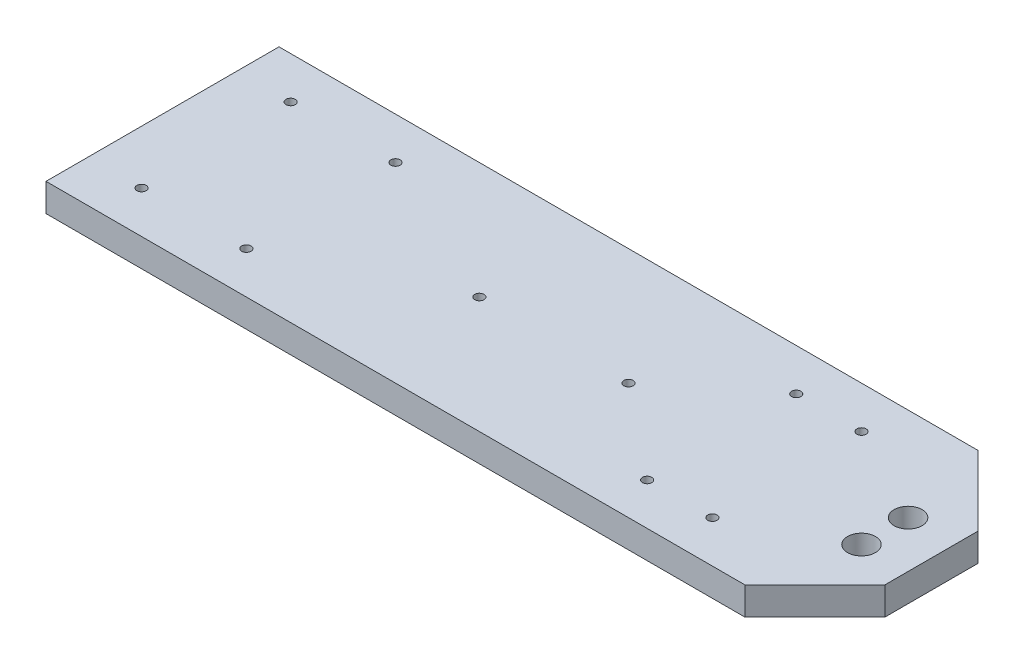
ISO-10303-21;
HEADER;
FILE_DESCRIPTION(('STEP AP214'),'2;1');
FILE_NAME('part.step','',(''),(''),'','','');
FILE_SCHEMA(('AUTOMOTIVE_DESIGN { 1 0 10303 214 1 1 1 1 }'));
ENDSEC;
DATA;
#1=APPLICATION_CONTEXT('core data for automotive mechanical design processes');
#2=APPLICATION_PROTOCOL_DEFINITION('international standard','automotive_design',2000,#1);
#3=PRODUCT_CONTEXT('',#1,'mechanical');
#4=PRODUCT('Part','Part','',(#3));
#5=PRODUCT_RELATED_PRODUCT_CATEGORY('part','',(#4));
#6=PRODUCT_DEFINITION_FORMATION('','',#4);
#7=PRODUCT_DEFINITION_CONTEXT('part definition',#1,'design');
#8=PRODUCT_DEFINITION('design','',#6,#7);
#9=PRODUCT_DEFINITION_SHAPE('','',#8);
#10=(LENGTH_UNIT() NAMED_UNIT(*) SI_UNIT(.MILLI.,.METRE.));
#11=(NAMED_UNIT(*) PLANE_ANGLE_UNIT() SI_UNIT($,.RADIAN.));
#12=(NAMED_UNIT(*) SI_UNIT($,.STERADIAN.) SOLID_ANGLE_UNIT());
#13=UNCERTAINTY_MEASURE_WITH_UNIT(LENGTH_MEASURE(1.E-05),#10,'distance_accuracy_value','');
#14=(GEOMETRIC_REPRESENTATION_CONTEXT(3) GLOBAL_UNCERTAINTY_ASSIGNED_CONTEXT((#13)) GLOBAL_UNIT_ASSIGNED_CONTEXT((#10,
#11,#12)) REPRESENTATION_CONTEXT('',''));
#15=CARTESIAN_POINT('',(0.,0.,0.));
#16=DIRECTION('',(0.,0.,1.));
#17=DIRECTION('',(1.,0.,0.));
#18=AXIS2_PLACEMENT_3D('',#15,#16,#17);
#19=CARTESIAN_POINT('',(0.,6.,0.));
#20=DIRECTION('',(1.,0.,0.));
#21=DIRECTION('',(0.,0.,-1.));
#22=AXIS2_PLACEMENT_3D('',#19,#20,#21);
#23=PLANE('',#22);
#24=DIRECTION('',(0.,0.,1.));
#25=VECTOR('',#24,1.);
#26=CARTESIAN_POINT('',(0.,0.,0.));
#27=LINE('',#26,#25);
#28=CARTESIAN_POINT('',(0.,0.,-50.));
#29=VERTEX_POINT('',#28);
#30=CARTESIAN_POINT('',(0.,0.,0.));
#31=VERTEX_POINT('',#30);
#32=EDGE_CURVE('E83',#29,#31,#27,.T.);
#33=ORIENTED_EDGE('',*,*,#32,.T.);
#34=DIRECTION('',(0.,-1.,0.));
#35=VECTOR('',#34,1.);
#36=CARTESIAN_POINT('',(0.,6.,0.));
#37=LINE('',#36,#35);
#38=CARTESIAN_POINT('',(0.,6.,0.));
#39=VERTEX_POINT('',#38);
#40=EDGE_CURVE('E89',#39,#31,#37,.T.);
#41=ORIENTED_EDGE('',*,*,#40,.F.);
#42=DIRECTION('',(0.,0.,1.));
#43=VECTOR('',#42,1.);
#44=CARTESIAN_POINT('',(0.,6.,0.));
#45=LINE('',#44,#43);
#46=CARTESIAN_POINT('',(0.,6.,-50.));
#47=VERTEX_POINT('',#46);
#48=EDGE_CURVE('E110',#47,#39,#45,.T.);
#49=ORIENTED_EDGE('',*,*,#48,.F.);
#50=DIRECTION('',(0.,-1.,0.));
#51=VECTOR('',#50,1.);
#52=CARTESIAN_POINT('',(0.,6.,-50.));
#53=LINE('',#52,#51);
#54=EDGE_CURVE('E96',#47,#29,#53,.T.);
#55=ORIENTED_EDGE('',*,*,#54,.T.);
#56=EDGE_LOOP('',(#33,#41,#49,#55));
#57=FACE_BOUND('',#56,.T.);
#58=ADVANCED_FACE('F26',(#57),#23,.F.);
#59=CARTESIAN_POINT('',(0.,6.,0.));
#60=DIRECTION('',(0.,0.,-1.));
#61=DIRECTION('',(-1.,0.,0.));
#62=AXIS2_PLACEMENT_3D('',#59,#60,#61);
#63=PLANE('',#62);
#64=DIRECTION('',(1.,0.,0.));
#65=VECTOR('',#64,1.);
#66=CARTESIAN_POINT('',(0.,0.,0.));
#67=LINE('',#66,#65);
#68=CARTESIAN_POINT('',(150.,0.,0.));
#69=VERTEX_POINT('',#68);
#70=EDGE_CURVE('E78',#31,#69,#67,.T.);
#71=ORIENTED_EDGE('',*,*,#70,.T.);
#72=DIRECTION('',(0.,1.,0.));
#73=VECTOR('',#72,1.);
#74=CARTESIAN_POINT('',(150.,6.,0.));
#75=LINE('',#74,#73);
#76=CARTESIAN_POINT('',(150.,6.,0.));
#77=VERTEX_POINT('',#76);
#78=EDGE_CURVE('E11',#69,#77,#75,.T.);
#79=ORIENTED_EDGE('',*,*,#78,.T.);
#80=DIRECTION('',(1.,0.,0.));
#81=VECTOR('',#80,1.);
#82=CARTESIAN_POINT('',(0.,6.,0.));
#83=LINE('',#82,#81);
#84=EDGE_CURVE('E91',#39,#77,#83,.T.);
#85=ORIENTED_EDGE('',*,*,#84,.F.);
#86=ORIENTED_EDGE('',*,*,#40,.T.);
#87=EDGE_LOOP('',(#71,#79,#85,#86));
#88=FACE_BOUND('',#87,.T.);
#89=ADVANCED_FACE('F90',(#88),#63,.F.);
#90=CARTESIAN_POINT('',(165.,6.,0.));
#91=DIRECTION('',(-1.,0.,0.));
#92=DIRECTION('',(0.,0.,1.));
#93=AXIS2_PLACEMENT_3D('',#90,#91,#92);
#94=PLANE('',#93);
#95=DIRECTION('',(0.,0.,-1.));
#96=VECTOR('',#95,1.);
#97=CARTESIAN_POINT('',(165.,0.,0.));
#98=LINE('',#97,#96);
#99=CARTESIAN_POINT('',(165.,0.,-15.));
#100=VERTEX_POINT('',#99);
#101=CARTESIAN_POINT('',(165.,0.,-35.));
#102=VERTEX_POINT('',#101);
#103=EDGE_CURVE('E86',#100,#102,#98,.T.);
#104=ORIENTED_EDGE('',*,*,#103,.T.);
#105=DIRECTION('',(0.,1.,0.));
#106=VECTOR('',#105,1.);
#107=CARTESIAN_POINT('',(165.,6.,-35.));
#108=LINE('',#107,#106);
#109=CARTESIAN_POINT('',(165.,6.,-35.));
#110=VERTEX_POINT('',#109);
#111=EDGE_CURVE('E46',#102,#110,#108,.T.);
#112=ORIENTED_EDGE('',*,*,#111,.T.);
#113=DIRECTION('',(0.,0.,-1.));
#114=VECTOR('',#113,1.);
#115=CARTESIAN_POINT('',(165.,6.,0.));
#116=LINE('',#115,#114);
#117=CARTESIAN_POINT('',(165.,6.,-15.));
#118=VERTEX_POINT('',#117);
#119=EDGE_CURVE('E113',#118,#110,#116,.T.);
#120=ORIENTED_EDGE('',*,*,#119,.F.);
#121=DIRECTION('',(0.,-1.,0.));
#122=VECTOR('',#121,1.);
#123=CARTESIAN_POINT('',(165.,6.,-15.));
#124=LINE('',#123,#122);
#125=EDGE_CURVE('E123',#118,#100,#124,.T.);
#126=ORIENTED_EDGE('',*,*,#125,.T.);
#127=EDGE_LOOP('',(#104,#112,#120,#126));
#128=FACE_BOUND('',#127,.T.);
#129=ADVANCED_FACE('F137',(#128),#94,.F.);
#130=CARTESIAN_POINT('',(0.,6.,-50.));
#131=DIRECTION('',(0.,0.,1.));
#132=DIRECTION('',(1.,0.,0.));
#133=AXIS2_PLACEMENT_3D('',#130,#131,#132);
#134=PLANE('',#133);
#135=DIRECTION('',(-1.,0.,0.));
#136=VECTOR('',#135,1.);
#137=CARTESIAN_POINT('',(0.,6.,-50.));
#138=LINE('',#137,#136);
#139=CARTESIAN_POINT('',(150.,6.,-50.));
#140=VERTEX_POINT('',#139);
#141=EDGE_CURVE('E115',#140,#47,#138,.T.);
#142=ORIENTED_EDGE('',*,*,#141,.F.);
#143=DIRECTION('',(0.,-1.,0.));
#144=VECTOR('',#143,1.);
#145=CARTESIAN_POINT('',(150.,6.,-50.));
#146=LINE('',#145,#144);
#147=CARTESIAN_POINT('',(150.,0.,-50.));
#148=VERTEX_POINT('',#147);
#149=EDGE_CURVE('E95',#140,#148,#146,.T.);
#150=ORIENTED_EDGE('',*,*,#149,.T.);
#151=DIRECTION('',(-1.,0.,0.));
#152=VECTOR('',#151,1.);
#153=CARTESIAN_POINT('',(0.,0.,-50.));
#154=LINE('',#153,#152);
#155=EDGE_CURVE('E108',#148,#29,#154,.T.);
#156=ORIENTED_EDGE('',*,*,#155,.T.);
#157=ORIENTED_EDGE('',*,*,#54,.F.);
#158=EDGE_LOOP('',(#142,#150,#156,#157));
#159=FACE_BOUND('',#158,.T.);
#160=ADVANCED_FACE('F135',(#159),#134,.F.);
#161=CARTESIAN_POINT('',(0.,6.,-50.));
#162=DIRECTION('',(0.,-1.,0.));
#163=DIRECTION('',(0.,0.,-1.));
#164=AXIS2_PLACEMENT_3D('',#161,#162,#163);
#165=PLANE('',#164);
#166=CARTESIAN_POINT('',(155.,6.,-20.));
#167=DIRECTION('',(0.,1.,0.));
#168=DIRECTION('',(0.,0.,-1.));
#169=AXIS2_PLACEMENT_3D('',#166,#167,#168);
#170=CIRCLE('',#169,2.99999999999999);
#171=CARTESIAN_POINT('',(155.,6.,-23.));
#172=VERTEX_POINT('',#171);
#173=EDGE_CURVE('E263',#172,#172,#170,.T.);
#174=ORIENTED_EDGE('',*,*,#173,.F.);
#175=EDGE_LOOP('',(#174));
#176=FACE_BOUND('',#175,.T.);
#177=CARTESIAN_POINT('',(155.,6.,-30.));
#178=DIRECTION('',(0.,1.,0.));
#179=DIRECTION('',(0.,0.,1.));
#180=AXIS2_PLACEMENT_3D('',#177,#178,#179);
#181=CIRCLE('',#180,2.99999999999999);
#182=CARTESIAN_POINT('',(155.,6.,-27.));
#183=VERTEX_POINT('',#182);
#184=EDGE_CURVE('E259',#183,#183,#181,.T.);
#185=ORIENTED_EDGE('',*,*,#184,.F.);
#186=EDGE_LOOP('',(#185));
#187=FACE_BOUND('',#186,.T.);
#188=CARTESIAN_POINT('',(134.,6.,-9.));
#189=DIRECTION('',(0.,1.,0.));
#190=DIRECTION('',(0.,0.,-1.));
#191=AXIS2_PLACEMENT_3D('',#188,#189,#190);
#192=CIRCLE('',#191,0.999999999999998);
#193=CARTESIAN_POINT('',(134.,6.,-10.));
#194=VERTEX_POINT('',#193);
#195=EDGE_CURVE('E255',#194,#194,#192,.T.);
#196=ORIENTED_EDGE('',*,*,#195,.F.);
#197=EDGE_LOOP('',(#196));
#198=FACE_BOUND('',#197,.T.);
#199=CARTESIAN_POINT('',(68.,6.,-25.));
#200=DIRECTION('',(0.,1.,0.));
#201=DIRECTION('',(0.,0.,1.));
#202=AXIS2_PLACEMENT_3D('',#199,#200,#201);
#203=CIRCLE('',#202,0.999999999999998);
#204=CARTESIAN_POINT('',(68.,6.,-24.));
#205=VERTEX_POINT('',#204);
#206=EDGE_CURVE('E251',#205,#205,#203,.T.);
#207=ORIENTED_EDGE('',*,*,#206,.F.);
#208=EDGE_LOOP('',(#207));
#209=FACE_BOUND('',#208,.T.);
#210=CARTESIAN_POINT('',(100.,6.,-25.));
#211=DIRECTION('',(0.,1.,0.));
#212=DIRECTION('',(0.,0.,1.));
#213=AXIS2_PLACEMENT_3D('',#210,#211,#212);
#214=CIRCLE('',#213,0.999999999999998);
#215=CARTESIAN_POINT('',(100.,6.,-24.));
#216=VERTEX_POINT('',#215);
#217=EDGE_CURVE('E247',#216,#216,#214,.T.);
#218=ORIENTED_EDGE('',*,*,#217,.F.);
#219=EDGE_LOOP('',(#218));
#220=FACE_BOUND('',#219,.T.);
#221=CARTESIAN_POINT('',(120.,6.,-9.));
#222=DIRECTION('',(0.,1.,0.));
#223=DIRECTION('',(0.,0.,-1.));
#224=AXIS2_PLACEMENT_3D('',#221,#222,#223);
#225=CIRCLE('',#224,0.999999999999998);
#226=CARTESIAN_POINT('',(120.,6.,-10.));
#227=VERTEX_POINT('',#226);
#228=EDGE_CURVE('E243',#227,#227,#225,.T.);
#229=ORIENTED_EDGE('',*,*,#228,.F.);
#230=EDGE_LOOP('',(#229));
#231=FACE_BOUND('',#230,.T.);
#232=CARTESIAN_POINT('',(34.,6.,-9.));
#233=DIRECTION('',(0.,1.,0.));
#234=DIRECTION('',(0.,0.,-1.));
#235=AXIS2_PLACEMENT_3D('',#232,#233,#234);
#236=CIRCLE('',#235,0.999999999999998);
#237=CARTESIAN_POINT('',(34.,6.,-10.));
#238=VERTEX_POINT('',#237);
#239=EDGE_CURVE('E239',#238,#238,#236,.T.);
#240=ORIENTED_EDGE('',*,*,#239,.F.);
#241=EDGE_LOOP('',(#240));
#242=FACE_BOUND('',#241,.T.);
#243=CARTESIAN_POINT('',(11.5,6.,-9.));
#244=DIRECTION('',(0.,1.,0.));
#245=DIRECTION('',(0.,0.,-1.));
#246=AXIS2_PLACEMENT_3D('',#243,#244,#245);
#247=CIRCLE('',#246,1.);
#248=CARTESIAN_POINT('',(11.5,6.,-10.));
#249=VERTEX_POINT('',#248);
#250=EDGE_CURVE('E235',#249,#249,#247,.T.);
#251=ORIENTED_EDGE('',*,*,#250,.F.);
#252=EDGE_LOOP('',(#251));
#253=FACE_BOUND('',#252,.T.);
#254=CARTESIAN_POINT('',(11.5,6.,-41.));
#255=DIRECTION('',(0.,1.,0.));
#256=DIRECTION('',(0.,0.,1.));
#257=AXIS2_PLACEMENT_3D('',#254,#255,#256);
#258=CIRCLE('',#257,1.);
#259=CARTESIAN_POINT('',(11.5,6.,-40.));
#260=VERTEX_POINT('',#259);
#261=EDGE_CURVE('E231',#260,#260,#258,.T.);
#262=ORIENTED_EDGE('',*,*,#261,.F.);
#263=EDGE_LOOP('',(#262));
#264=FACE_BOUND('',#263,.T.);
#265=CARTESIAN_POINT('',(34.,6.,-41.));
#266=DIRECTION('',(0.,1.,0.));
#267=DIRECTION('',(0.,0.,1.));
#268=AXIS2_PLACEMENT_3D('',#265,#266,#267);
#269=CIRCLE('',#268,0.999999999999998);
#270=CARTESIAN_POINT('',(34.,6.,-40.));
#271=VERTEX_POINT('',#270);
#272=EDGE_CURVE('E227',#271,#271,#269,.T.);
#273=ORIENTED_EDGE('',*,*,#272,.F.);
#274=EDGE_LOOP('',(#273));
#275=FACE_BOUND('',#274,.T.);
#276=CARTESIAN_POINT('',(120.,6.,-41.));
#277=DIRECTION('',(0.,1.,0.));
#278=DIRECTION('',(0.,0.,1.));
#279=AXIS2_PLACEMENT_3D('',#276,#277,#278);
#280=CIRCLE('',#279,0.999999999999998);
#281=CARTESIAN_POINT('',(120.,6.,-40.));
#282=VERTEX_POINT('',#281);
#283=EDGE_CURVE('E221',#282,#282,#280,.T.);
#284=ORIENTED_EDGE('',*,*,#283,.F.);
#285=EDGE_LOOP('',(#284));
#286=FACE_BOUND('',#285,.T.);
#287=CARTESIAN_POINT('',(134.,6.,-41.));
#288=DIRECTION('',(0.,1.,0.));
#289=DIRECTION('',(0.,0.,1.));
#290=AXIS2_PLACEMENT_3D('',#287,#288,#289);
#291=CIRCLE('',#290,0.999999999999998);
#292=CARTESIAN_POINT('',(134.,6.,-40.));
#293=VERTEX_POINT('',#292);
#294=EDGE_CURVE('E103',#293,#293,#291,.T.);
#295=ORIENTED_EDGE('',*,*,#294,.F.);
#296=EDGE_LOOP('',(#295));
#297=FACE_BOUND('',#296,.T.);
#298=ORIENTED_EDGE('',*,*,#119,.T.);
#299=DIRECTION('',(0.707106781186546,0.,0.707106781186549));
#300=VECTOR('',#299,1.);
#301=CARTESIAN_POINT('',(150.,6.,-50.));
#302=LINE('',#301,#300);
#303=EDGE_CURVE('E33',#110,#140,#302,.F.);
#304=ORIENTED_EDGE('',*,*,#303,.T.);
#305=ORIENTED_EDGE('',*,*,#141,.T.);
#306=ORIENTED_EDGE('',*,*,#48,.T.);
#307=ORIENTED_EDGE('',*,*,#84,.T.);
#308=DIRECTION('',(-0.707106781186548,0.,0.707106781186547));
#309=VECTOR('',#308,1.);
#310=CARTESIAN_POINT('',(165.,6.,-15.));
#311=LINE('',#310,#309);
#312=EDGE_CURVE('E127',#77,#118,#311,.F.);
#313=ORIENTED_EDGE('',*,*,#312,.T.);
#314=EDGE_LOOP('',(#298,#304,#305,#306,#307,#313));
#315=FACE_BOUND('',#314,.T.);
#316=ADVANCED_FACE('F131',(#176,#187,#198,#209,#220,#231,#242,#253,#264,#275,#286,#297,#315),
#165,.F.);
#317=CARTESIAN_POINT('',(0.,0.,-50.));
#318=DIRECTION('',(0.,-1.,0.));
#319=DIRECTION('',(0.,0.,-1.));
#320=AXIS2_PLACEMENT_3D('',#317,#318,#319);
#321=PLANE('',#320);
#322=CARTESIAN_POINT('',(155.,0.,-20.));
#323=DIRECTION('',(0.,1.,0.));
#324=DIRECTION('',(0.,0.,-1.));
#325=AXIS2_PLACEMENT_3D('',#322,#323,#324);
#326=CIRCLE('',#325,2.99999999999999);
#327=CARTESIAN_POINT('',(155.,0.,-23.));
#328=VERTEX_POINT('',#327);
#329=EDGE_CURVE('E175',#328,#328,#326,.T.);
#330=ORIENTED_EDGE('',*,*,#329,.T.);
#331=EDGE_LOOP('',(#330));
#332=FACE_BOUND('',#331,.T.);
#333=CARTESIAN_POINT('',(155.,0.,-30.));
#334=DIRECTION('',(0.,1.,0.));
#335=DIRECTION('',(0.,0.,1.));
#336=AXIS2_PLACEMENT_3D('',#333,#334,#335);
#337=CIRCLE('',#336,2.99999999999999);
#338=CARTESIAN_POINT('',(155.,0.,-27.));
#339=VERTEX_POINT('',#338);
#340=EDGE_CURVE('E179',#339,#339,#337,.T.);
#341=ORIENTED_EDGE('',*,*,#340,.T.);
#342=EDGE_LOOP('',(#341));
#343=FACE_BOUND('',#342,.T.);
#344=CARTESIAN_POINT('',(134.,0.,-9.));
#345=DIRECTION('',(0.,1.,0.));
#346=DIRECTION('',(0.,0.,-1.));
#347=AXIS2_PLACEMENT_3D('',#344,#345,#346);
#348=CIRCLE('',#347,0.999999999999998);
#349=CARTESIAN_POINT('',(134.,0.,-10.));
#350=VERTEX_POINT('',#349);
#351=EDGE_CURVE('E183',#350,#350,#348,.T.);
#352=ORIENTED_EDGE('',*,*,#351,.T.);
#353=EDGE_LOOP('',(#352));
#354=FACE_BOUND('',#353,.T.);
#355=CARTESIAN_POINT('',(68.,0.,-25.));
#356=DIRECTION('',(0.,1.,0.));
#357=DIRECTION('',(0.,0.,1.));
#358=AXIS2_PLACEMENT_3D('',#355,#356,#357);
#359=CIRCLE('',#358,0.999999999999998);
#360=CARTESIAN_POINT('',(68.,0.,-24.));
#361=VERTEX_POINT('',#360);
#362=EDGE_CURVE('E187',#361,#361,#359,.T.);
#363=ORIENTED_EDGE('',*,*,#362,.T.);
#364=EDGE_LOOP('',(#363));
#365=FACE_BOUND('',#364,.T.);
#366=CARTESIAN_POINT('',(100.,0.,-25.));
#367=DIRECTION('',(0.,1.,0.));
#368=DIRECTION('',(0.,0.,1.));
#369=AXIS2_PLACEMENT_3D('',#366,#367,#368);
#370=CIRCLE('',#369,0.999999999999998);
#371=CARTESIAN_POINT('',(100.,0.,-24.));
#372=VERTEX_POINT('',#371);
#373=EDGE_CURVE('E191',#372,#372,#370,.T.);
#374=ORIENTED_EDGE('',*,*,#373,.T.);
#375=EDGE_LOOP('',(#374));
#376=FACE_BOUND('',#375,.T.);
#377=CARTESIAN_POINT('',(120.,0.,-9.));
#378=DIRECTION('',(0.,1.,0.));
#379=DIRECTION('',(0.,0.,-1.));
#380=AXIS2_PLACEMENT_3D('',#377,#378,#379);
#381=CIRCLE('',#380,0.999999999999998);
#382=CARTESIAN_POINT('',(120.,0.,-10.));
#383=VERTEX_POINT('',#382);
#384=EDGE_CURVE('E195',#383,#383,#381,.T.);
#385=ORIENTED_EDGE('',*,*,#384,.T.);
#386=EDGE_LOOP('',(#385));
#387=FACE_BOUND('',#386,.T.);
#388=CARTESIAN_POINT('',(34.,0.,-9.));
#389=DIRECTION('',(0.,1.,0.));
#390=DIRECTION('',(0.,0.,-1.));
#391=AXIS2_PLACEMENT_3D('',#388,#389,#390);
#392=CIRCLE('',#391,0.999999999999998);
#393=CARTESIAN_POINT('',(34.,0.,-10.));
#394=VERTEX_POINT('',#393);
#395=EDGE_CURVE('E199',#394,#394,#392,.T.);
#396=ORIENTED_EDGE('',*,*,#395,.T.);
#397=EDGE_LOOP('',(#396));
#398=FACE_BOUND('',#397,.T.);
#399=CARTESIAN_POINT('',(11.5,0.,-9.));
#400=DIRECTION('',(0.,1.,0.));
#401=DIRECTION('',(0.,0.,-1.));
#402=AXIS2_PLACEMENT_3D('',#399,#400,#401);
#403=CIRCLE('',#402,1.);
#404=CARTESIAN_POINT('',(11.5,0.,-10.));
#405=VERTEX_POINT('',#404);
#406=EDGE_CURVE('E203',#405,#405,#403,.T.);
#407=ORIENTED_EDGE('',*,*,#406,.T.);
#408=EDGE_LOOP('',(#407));
#409=FACE_BOUND('',#408,.T.);
#410=CARTESIAN_POINT('',(11.5,0.,-41.));
#411=DIRECTION('',(0.,1.,0.));
#412=DIRECTION('',(0.,0.,1.));
#413=AXIS2_PLACEMENT_3D('',#410,#411,#412);
#414=CIRCLE('',#413,1.);
#415=CARTESIAN_POINT('',(11.5,0.,-40.));
#416=VERTEX_POINT('',#415);
#417=EDGE_CURVE('E207',#416,#416,#414,.T.);
#418=ORIENTED_EDGE('',*,*,#417,.T.);
#419=EDGE_LOOP('',(#418));
#420=FACE_BOUND('',#419,.T.);
#421=CARTESIAN_POINT('',(34.,0.,-41.));
#422=DIRECTION('',(0.,1.,0.));
#423=DIRECTION('',(0.,0.,1.));
#424=AXIS2_PLACEMENT_3D('',#421,#422,#423);
#425=CIRCLE('',#424,0.999999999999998);
#426=CARTESIAN_POINT('',(34.,0.,-40.));
#427=VERTEX_POINT('',#426);
#428=EDGE_CURVE('E211',#427,#427,#425,.T.);
#429=ORIENTED_EDGE('',*,*,#428,.T.);
#430=EDGE_LOOP('',(#429));
#431=FACE_BOUND('',#430,.T.);
#432=CARTESIAN_POINT('',(120.,0.,-41.));
#433=DIRECTION('',(0.,1.,0.));
#434=DIRECTION('',(0.,0.,1.));
#435=AXIS2_PLACEMENT_3D('',#432,#433,#434);
#436=CIRCLE('',#435,0.999999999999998);
#437=CARTESIAN_POINT('',(120.,0.,-40.));
#438=VERTEX_POINT('',#437);
#439=EDGE_CURVE('E215',#438,#438,#436,.T.);
#440=ORIENTED_EDGE('',*,*,#439,.T.);
#441=EDGE_LOOP('',(#440));
#442=FACE_BOUND('',#441,.T.);
#443=CARTESIAN_POINT('',(134.,0.,-41.));
#444=DIRECTION('',(0.,1.,0.));
#445=DIRECTION('',(0.,0.,1.));
#446=AXIS2_PLACEMENT_3D('',#443,#444,#445);
#447=CIRCLE('',#446,0.999999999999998);
#448=CARTESIAN_POINT('',(134.,0.,-40.));
#449=VERTEX_POINT('',#448);
#450=EDGE_CURVE('E100',#449,#449,#447,.T.);
#451=ORIENTED_EDGE('',*,*,#450,.T.);
#452=EDGE_LOOP('',(#451));
#453=FACE_BOUND('',#452,.T.);
#454=ORIENTED_EDGE('',*,*,#155,.F.);
#455=DIRECTION('',(-0.707106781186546,0.,-0.707106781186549));
#456=VECTOR('',#455,1.);
#457=CARTESIAN_POINT('',(75.0000000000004,0.,-125.));
#458=LINE('',#457,#456);
#459=EDGE_CURVE('E121',#148,#102,#458,.F.);
#460=ORIENTED_EDGE('',*,*,#459,.T.);
#461=ORIENTED_EDGE('',*,*,#103,.F.);
#462=DIRECTION('',(0.707106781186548,0.,-0.707106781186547));
#463=VECTOR('',#462,1.);
#464=CARTESIAN_POINT('',(99.9999999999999,0.,50.));
#465=LINE('',#464,#463);
#466=EDGE_CURVE('E85',#100,#69,#465,.F.);
#467=ORIENTED_EDGE('',*,*,#466,.T.);
#468=ORIENTED_EDGE('',*,*,#70,.F.);
#469=ORIENTED_EDGE('',*,*,#32,.F.);
#470=EDGE_LOOP('',(#454,#460,#461,#467,#468,#469));
#471=FACE_BOUND('',#470,.T.);
#472=ADVANCED_FACE('F81',(#332,#343,#354,#365,#376,#387,#398,#409,#420,#431,#442,#453,#471),
#321,.T.);
#473=CARTESIAN_POINT('',(150.,6.,-50.));
#474=DIRECTION('',(-0.707106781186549,0.,0.707106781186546));
#475=DIRECTION('',(0.707106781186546,0.,0.707106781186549));
#476=AXIS2_PLACEMENT_3D('',#473,#474,#475);
#477=PLANE('',#476);
#478=ORIENTED_EDGE('',*,*,#303,.F.);
#479=ORIENTED_EDGE('',*,*,#111,.F.);
#480=ORIENTED_EDGE('',*,*,#459,.F.);
#481=ORIENTED_EDGE('',*,*,#149,.F.);
#482=EDGE_LOOP('',(#478,#479,#480,#481));
#483=FACE_BOUND('',#482,.T.);
#484=ADVANCED_FACE('F136',(#483),#477,.F.);
#485=CARTESIAN_POINT('',(165.,6.,-15.));
#486=DIRECTION('',(-0.707106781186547,0.,-0.707106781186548));
#487=DIRECTION('',(-0.707106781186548,0.,0.707106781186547));
#488=AXIS2_PLACEMENT_3D('',#485,#486,#487);
#489=PLANE('',#488);
#490=ORIENTED_EDGE('',*,*,#312,.F.);
#491=ORIENTED_EDGE('',*,*,#78,.F.);
#492=ORIENTED_EDGE('',*,*,#466,.F.);
#493=ORIENTED_EDGE('',*,*,#125,.F.);
#494=EDGE_LOOP('',(#490,#491,#492,#493));
#495=FACE_BOUND('',#494,.T.);
#496=ADVANCED_FACE('F141',(#495),#489,.F.);
#497=CARTESIAN_POINT('',(134.,0.,-41.));
#498=DIRECTION('',(0.,1.,0.));
#499=DIRECTION('',(0.,0.,1.));
#500=AXIS2_PLACEMENT_3D('',#497,#498,#499);
#501=CYLINDRICAL_SURFACE('',#500,0.999999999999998);
#502=ORIENTED_EDGE('',*,*,#450,.F.);
#503=EDGE_LOOP('',(#502));
#504=FACE_BOUND('',#503,.T.);
#505=ORIENTED_EDGE('',*,*,#294,.T.);
#506=EDGE_LOOP('',(#505));
#507=FACE_BOUND('',#506,.T.);
#508=ADVANCED_FACE('F143',(#504,#507),#501,.F.);
#509=CARTESIAN_POINT('',(120.,0.,-41.));
#510=DIRECTION('',(0.,1.,0.));
#511=DIRECTION('',(0.,0.,1.));
#512=AXIS2_PLACEMENT_3D('',#509,#510,#511);
#513=CYLINDRICAL_SURFACE('',#512,0.999999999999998);
#514=ORIENTED_EDGE('',*,*,#439,.F.);
#515=EDGE_LOOP('',(#514));
#516=FACE_BOUND('',#515,.T.);
#517=ORIENTED_EDGE('',*,*,#283,.T.);
#518=EDGE_LOOP('',(#517));
#519=FACE_BOUND('',#518,.T.);
#520=ADVANCED_FACE('F149',(#516,#519),#513,.F.);
#521=CARTESIAN_POINT('',(34.,0.,-41.));
#522=DIRECTION('',(0.,1.,0.));
#523=DIRECTION('',(0.,0.,1.));
#524=AXIS2_PLACEMENT_3D('',#521,#522,#523);
#525=CYLINDRICAL_SURFACE('',#524,0.999999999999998);
#526=ORIENTED_EDGE('',*,*,#428,.F.);
#527=EDGE_LOOP('',(#526));
#528=FACE_BOUND('',#527,.T.);
#529=ORIENTED_EDGE('',*,*,#272,.T.);
#530=EDGE_LOOP('',(#529));
#531=FACE_BOUND('',#530,.T.);
#532=ADVANCED_FACE('F290',(#528,#531),#525,.F.);
#533=CARTESIAN_POINT('',(11.5,0.,-41.));
#534=DIRECTION('',(0.,1.,0.));
#535=DIRECTION('',(0.,0.,1.));
#536=AXIS2_PLACEMENT_3D('',#533,#534,#535);
#537=CYLINDRICAL_SURFACE('',#536,1.);
#538=ORIENTED_EDGE('',*,*,#417,.F.);
#539=EDGE_LOOP('',(#538));
#540=FACE_BOUND('',#539,.T.);
#541=ORIENTED_EDGE('',*,*,#261,.T.);
#542=EDGE_LOOP('',(#541));
#543=FACE_BOUND('',#542,.T.);
#544=ADVANCED_FACE('F296',(#540,#543),#537,.F.);
#545=CARTESIAN_POINT('',(11.5,0.,-9.));
#546=DIRECTION('',(0.,1.,0.));
#547=DIRECTION('',(0.,0.,1.));
#548=AXIS2_PLACEMENT_3D('',#545,#546,#547);
#549=CYLINDRICAL_SURFACE('',#548,1.);
#550=ORIENTED_EDGE('',*,*,#406,.F.);
#551=EDGE_LOOP('',(#550));
#552=FACE_BOUND('',#551,.T.);
#553=ORIENTED_EDGE('',*,*,#250,.T.);
#554=EDGE_LOOP('',(#553));
#555=FACE_BOUND('',#554,.T.);
#556=ADVANCED_FACE('F302',(#552,#555),#549,.F.);
#557=CARTESIAN_POINT('',(34.,0.,-9.));
#558=DIRECTION('',(0.,1.,0.));
#559=DIRECTION('',(0.,0.,1.));
#560=AXIS2_PLACEMENT_3D('',#557,#558,#559);
#561=CYLINDRICAL_SURFACE('',#560,0.999999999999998);
#562=ORIENTED_EDGE('',*,*,#395,.F.);
#563=EDGE_LOOP('',(#562));
#564=FACE_BOUND('',#563,.T.);
#565=ORIENTED_EDGE('',*,*,#239,.T.);
#566=EDGE_LOOP('',(#565));
#567=FACE_BOUND('',#566,.T.);
#568=ADVANCED_FACE('F306',(#564,#567),#561,.F.);
#569=CARTESIAN_POINT('',(120.,0.,-9.));
#570=DIRECTION('',(0.,1.,0.));
#571=DIRECTION('',(0.,0.,1.));
#572=AXIS2_PLACEMENT_3D('',#569,#570,#571);
#573=CYLINDRICAL_SURFACE('',#572,0.999999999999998);
#574=ORIENTED_EDGE('',*,*,#384,.F.);
#575=EDGE_LOOP('',(#574));
#576=FACE_BOUND('',#575,.T.);
#577=ORIENTED_EDGE('',*,*,#228,.T.);
#578=EDGE_LOOP('',(#577));
#579=FACE_BOUND('',#578,.T.);
#580=ADVANCED_FACE('F310',(#576,#579),#573,.F.);
#581=CARTESIAN_POINT('',(100.,0.,-25.));
#582=DIRECTION('',(0.,1.,0.));
#583=DIRECTION('',(0.,0.,1.));
#584=AXIS2_PLACEMENT_3D('',#581,#582,#583);
#585=CYLINDRICAL_SURFACE('',#584,0.999999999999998);
#586=ORIENTED_EDGE('',*,*,#373,.F.);
#587=EDGE_LOOP('',(#586));
#588=FACE_BOUND('',#587,.T.);
#589=ORIENTED_EDGE('',*,*,#217,.T.);
#590=EDGE_LOOP('',(#589));
#591=FACE_BOUND('',#590,.T.);
#592=ADVANCED_FACE('F314',(#588,#591),#585,.F.);
#593=CARTESIAN_POINT('',(68.,0.,-25.));
#594=DIRECTION('',(0.,1.,0.));
#595=DIRECTION('',(0.,0.,1.));
#596=AXIS2_PLACEMENT_3D('',#593,#594,#595);
#597=CYLINDRICAL_SURFACE('',#596,0.999999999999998);
#598=ORIENTED_EDGE('',*,*,#362,.F.);
#599=EDGE_LOOP('',(#598));
#600=FACE_BOUND('',#599,.T.);
#601=ORIENTED_EDGE('',*,*,#206,.T.);
#602=EDGE_LOOP('',(#601));
#603=FACE_BOUND('',#602,.T.);
#604=ADVANCED_FACE('F318',(#600,#603),#597,.F.);
#605=CARTESIAN_POINT('',(134.,0.,-9.));
#606=DIRECTION('',(0.,1.,0.));
#607=DIRECTION('',(0.,0.,1.));
#608=AXIS2_PLACEMENT_3D('',#605,#606,#607);
#609=CYLINDRICAL_SURFACE('',#608,0.999999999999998);
#610=ORIENTED_EDGE('',*,*,#351,.F.);
#611=EDGE_LOOP('',(#610));
#612=FACE_BOUND('',#611,.T.);
#613=ORIENTED_EDGE('',*,*,#195,.T.);
#614=EDGE_LOOP('',(#613));
#615=FACE_BOUND('',#614,.T.);
#616=ADVANCED_FACE('F322',(#612,#615),#609,.F.);
#617=CARTESIAN_POINT('',(155.,0.,-30.));
#618=DIRECTION('',(0.,1.,0.));
#619=DIRECTION('',(0.,0.,1.));
#620=AXIS2_PLACEMENT_3D('',#617,#618,#619);
#621=CYLINDRICAL_SURFACE('',#620,2.99999999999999);
#622=ORIENTED_EDGE('',*,*,#340,.F.);
#623=EDGE_LOOP('',(#622));
#624=FACE_BOUND('',#623,.T.);
#625=ORIENTED_EDGE('',*,*,#184,.T.);
#626=EDGE_LOOP('',(#625));
#627=FACE_BOUND('',#626,.T.);
#628=ADVANCED_FACE('F326',(#624,#627),#621,.F.);
#629=CARTESIAN_POINT('',(155.,0.,-20.));
#630=DIRECTION('',(0.,1.,0.));
#631=DIRECTION('',(0.,0.,1.));
#632=AXIS2_PLACEMENT_3D('',#629,#630,#631);
#633=CYLINDRICAL_SURFACE('',#632,2.99999999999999);
#634=ORIENTED_EDGE('',*,*,#329,.F.);
#635=EDGE_LOOP('',(#634));
#636=FACE_BOUND('',#635,.T.);
#637=ORIENTED_EDGE('',*,*,#173,.T.);
#638=EDGE_LOOP('',(#637));
#639=FACE_BOUND('',#638,.T.);
#640=ADVANCED_FACE('F267',(#636,#639),#633,.F.);
#641=CLOSED_SHELL('',(#58,#89,#129,#160,#316,#472,#484,#496,#508,#520,#532,#544,#556,#568,#580,
#592,#604,#616,#628,#640));
#642=MANIFOLD_SOLID_BREP('B2',#641);
#643=ADVANCED_BREP_SHAPE_REPRESENTATION('',(#18,#642),#14);
#644=SHAPE_DEFINITION_REPRESENTATION(#9,#643);
ENDSEC;
END-ISO-10303-21;
